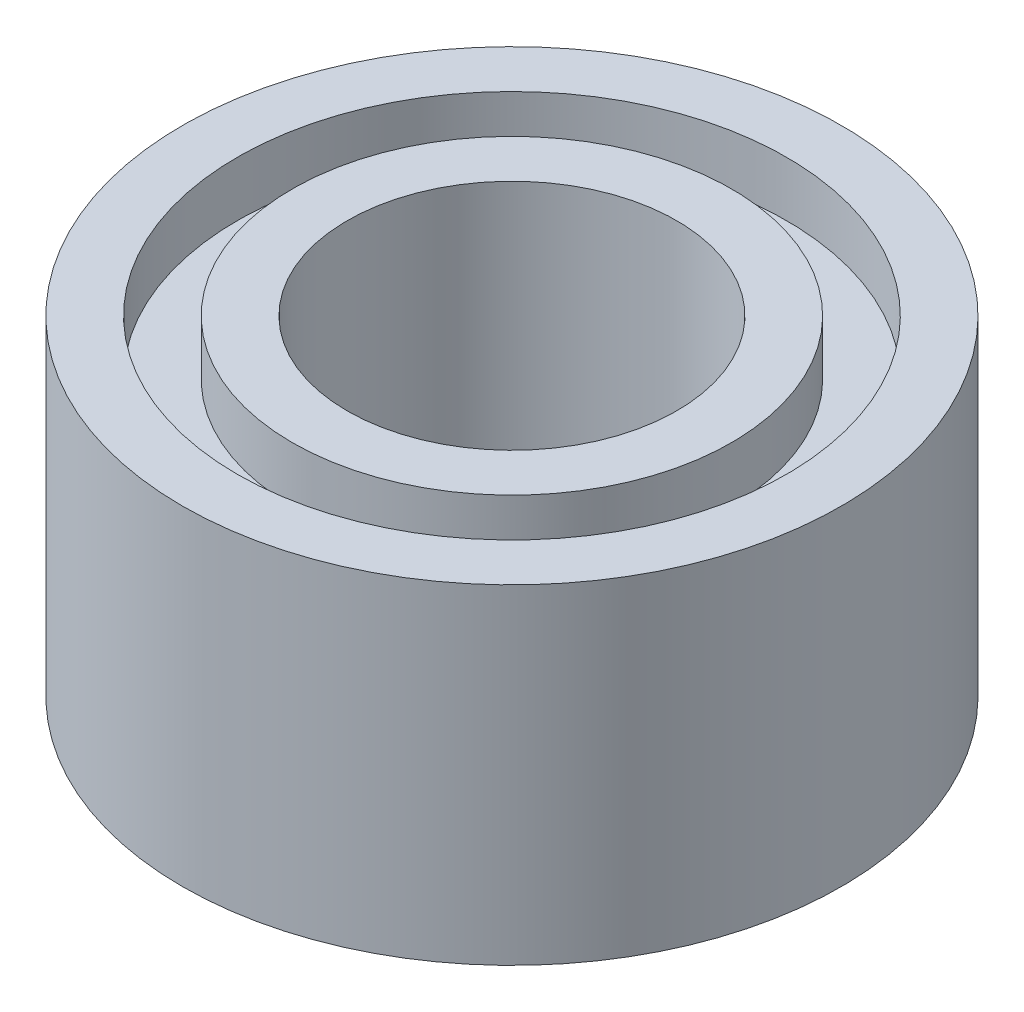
from build123d import *

# Parameters (mm, degrees)
SKETCH1_R           = 3
SKETCH1_R_2         = 1.5
BOSS_EXTRUDE1_DEPTH = 3
SKETCH2_R           = 2.5
SKETCH2_R_2         = 2
CUT_EXTRUDE1_DEPTH  = 0.5
CUT_EXTRUDE2_START  = -0.5
SKETCH3_R           = 2.5
SKETCH3_R_2         = 2
CUT_EXTRUDE2_DEPTH  = 0.5


with BuildPart() as part:
    # Sketch1 → Boss-Extrude1 (new body)
    with BuildSketch(Plane(origin=(0, 0, 0), x_dir=(1, 0, 0), z_dir=(0, 1, 0))):
        with Locations(Location((0, 0, 0), (0, 0, 270))):
            Circle(SKETCH1_R)
        with Locations(Location((0, 0, 0), (0, 0, 270))):
            Circle(SKETCH1_R_2, mode=Mode.SUBTRACT)
    extrude(amount=BOSS_EXTRUDE1_DEPTH)

    # Sketch2 → Cut-Extrude1 (cut)
    with BuildSketch(Plane(origin=(0, 3, 0), x_dir=(1, 0, 0), z_dir=(0, 1, 0))):
        with Locations(Location((0, 0, 0), (0, 0, 270))):
            Circle(SKETCH2_R)
        with Locations(Location((0, 0, 0), (0, 0, 270))):
            Circle(SKETCH2_R_2, mode=Mode.SUBTRACT)
    extrude(amount=-CUT_EXTRUDE1_DEPTH, mode=Mode.SUBTRACT)

    # Sketch3 → Cut-Extrude2 (cut)
    with BuildSketch(Plane(origin=(0, 0, 0), x_dir=(-1, 0, 0), z_dir=(0, -1, 0)).offset(CUT_EXTRUDE2_START)):
        with Locations(Location((0, 0, 0), (0, 0, 270))):
            Circle(SKETCH3_R)
        with Locations(Location((0, 0, 0), (0, 0, 270))):
            Circle(SKETCH3_R_2, mode=Mode.SUBTRACT)
    extrude(amount=CUT_EXTRUDE2_DEPTH, mode=Mode.SUBTRACT)


solid = part.part
